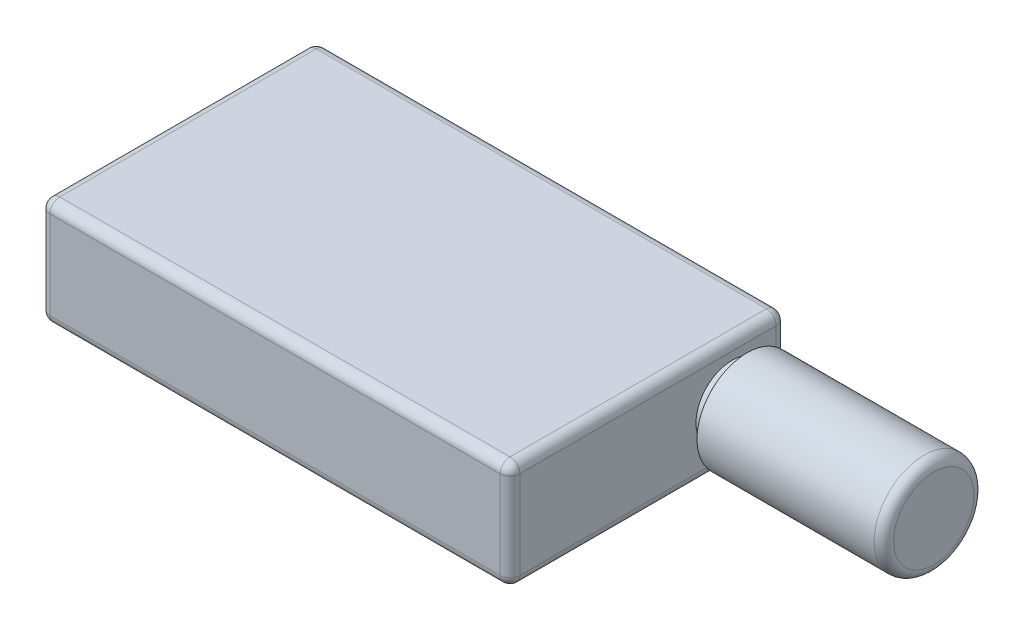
from build123d import *

# Parameters (mm, degrees)
SKETCH1_W           = 48
SKETCH1_H           = 28.2
BOSS_EXTRUDE1_DEPTH = 11
SKETCH2_R           = 3.7
BOSS_EXTRUDE2_DEPTH = 1.5
SKETCH3_R           = 5.1
BOSS_EXTRUDE3_DEPTH = 19.1
FILLET1_R           = 1
FILLET2_R           = 1
FILLET3_R           = 1


with BuildPart() as part:
    # Sketch1 → Boss-Extrude1 (new body)
    with BuildSketch(Plane(origin=(0, 0, 0), x_dir=(1, 0, 0), z_dir=(0, 1, 0))):
        with Locations((24, 14.1)):
            Rectangle(SKETCH1_W, SKETCH1_H)
    extrude(amount=BOSS_EXTRUDE1_DEPTH)

    # Sketch2 → Boss-Extrude2 (add)
    with BuildSketch(Plane(origin=(48, 0, 0), x_dir=(0, 0, -1), z_dir=(1, 0, 0))):
        with Locations(Location((22.7, 5.5, 0), (0, 0, 180))):
            Circle(SKETCH2_R)
    extrude(amount=BOSS_EXTRUDE2_DEPTH)

    # Sketch3 → Boss-Extrude3 (add)
    with BuildSketch(Plane(origin=(49.5, 0, 0), x_dir=(0, 0, -1), z_dir=(1, 0, 0))):
        with Locations((22.7, 5.5)):
            Circle(SKETCH3_R)
    extrude(amount=BOSS_EXTRUDE3_DEPTH)

    # Fillet1
    fillet1_edges = [part.edges().sort_by_distance(p)[0] for p in [
        (48, 11, -14.1),
        (24, 11, -28.2),
        (0, 11, -14.1),
        (24, 0, -28.2),
        (48, 0, -14.1),
        (24, 0, 0),
        (0, 0, -14.1),
        (0, 5.5, -28.2),
        (48, 5.5, -28.2),
        (48, 5.5, 0),
        (0, 5.5, 0),
        (24, 11, 0),
    ]]
    fillet(fillet1_edges, radius=FILLET1_R)

    # Fillet2
    fillet2_edges = [part.edges().sort_by_distance(p)[0] for p in [
        (68.6, 5.5, -17.6),
    ]]
    fillet(fillet2_edges, radius=FILLET2_R)

    # Fillet3
    fillet3_edges = [part.edges().sort_by_distance(p)[0] for p in [
        (49.5, 5.5, -26.4),
    ]]
    fillet(fillet3_edges, radius=FILLET3_R)


solid = part.part
